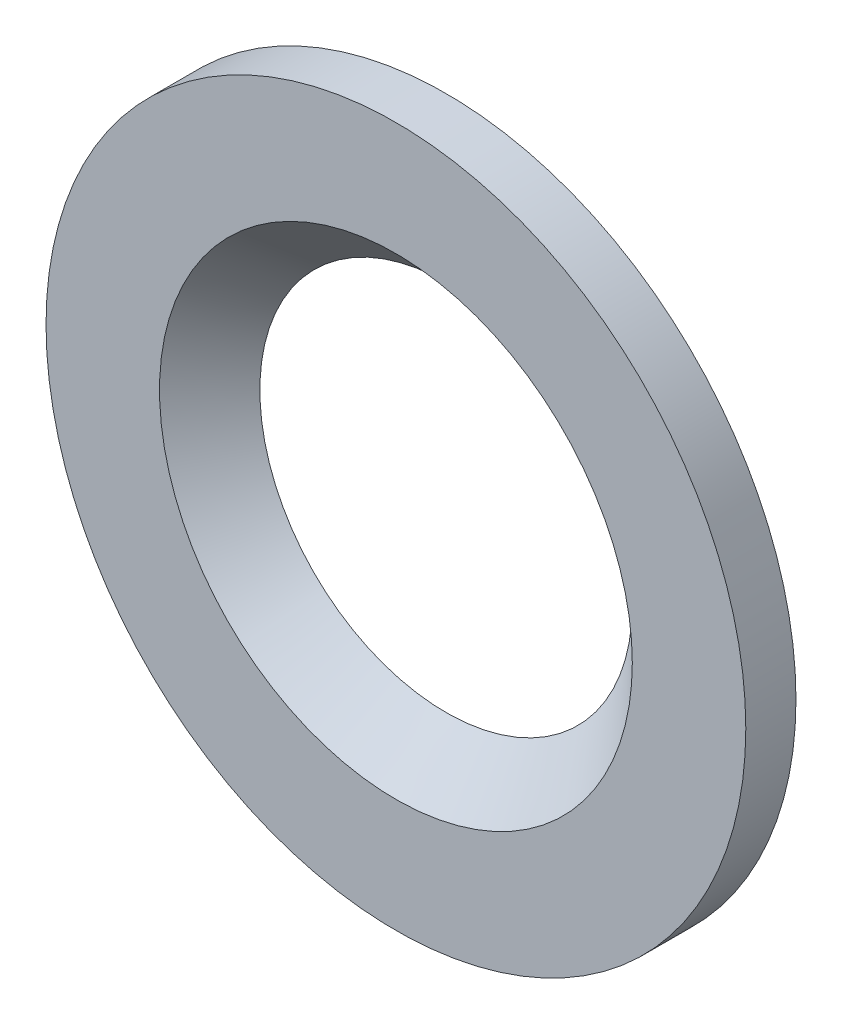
ISO-10303-21;
HEADER;
FILE_DESCRIPTION(('STEP AP214'),'2;1');
FILE_NAME('part.step','',(''),(''),'','','');
FILE_SCHEMA(('AUTOMOTIVE_DESIGN { 1 0 10303 214 1 1 1 1 }'));
ENDSEC;
DATA;
#1=APPLICATION_CONTEXT('core data for automotive mechanical design processes');
#2=APPLICATION_PROTOCOL_DEFINITION('international standard','automotive_design',2000,#1);
#3=PRODUCT_CONTEXT('',#1,'mechanical');
#4=PRODUCT('Part','Part','',(#3));
#5=PRODUCT_RELATED_PRODUCT_CATEGORY('part','',(#4));
#6=PRODUCT_DEFINITION_FORMATION('','',#4);
#7=PRODUCT_DEFINITION_CONTEXT('part definition',#1,'design');
#8=PRODUCT_DEFINITION('design','',#6,#7);
#9=PRODUCT_DEFINITION_SHAPE('','',#8);
#10=(LENGTH_UNIT() NAMED_UNIT(*) SI_UNIT(.MILLI.,.METRE.));
#11=(NAMED_UNIT(*) PLANE_ANGLE_UNIT() SI_UNIT($,.RADIAN.));
#12=(NAMED_UNIT(*) SI_UNIT($,.STERADIAN.) SOLID_ANGLE_UNIT());
#13=UNCERTAINTY_MEASURE_WITH_UNIT(LENGTH_MEASURE(1.E-05),#10,'distance_accuracy_value','');
#14=(GEOMETRIC_REPRESENTATION_CONTEXT(3) GLOBAL_UNCERTAINTY_ASSIGNED_CONTEXT((#13)) GLOBAL_UNIT_ASSIGNED_CONTEXT((#10,
#11,#12)) REPRESENTATION_CONTEXT('',''));
#15=CARTESIAN_POINT('',(0.,0.,0.));
#16=DIRECTION('',(0.,0.,1.));
#17=DIRECTION('',(1.,0.,0.));
#18=AXIS2_PLACEMENT_3D('',#15,#16,#17);
#19=CARTESIAN_POINT('',(0.,0.,-1.016));
#20=DIRECTION('',(0.,0.,1.));
#21=DIRECTION('',(1.,0.,0.));
#22=AXIS2_PLACEMENT_3D('',#19,#20,#21);
#23=PLANE('',#22);
#24=CARTESIAN_POINT('',(0.,0.,-1.016));
#25=DIRECTION('',(0.,0.,1.));
#26=DIRECTION('',(1.,0.,0.));
#27=AXIS2_PLACEMENT_3D('',#24,#25,#26);
#28=CIRCLE('',#27,7.0866);
#29=CARTESIAN_POINT('',(7.0866,0.,-1.016));
#30=VERTEX_POINT('',#29);
#31=EDGE_CURVE('E10',#30,#30,#28,.T.);
#32=ORIENTED_EDGE('',*,*,#31,.F.);
#33=EDGE_LOOP('',(#32));
#34=FACE_BOUND('',#33,.T.);
#35=CARTESIAN_POINT('',(0.,0.,-1.016));
#36=DIRECTION('',(0.,0.,1.));
#37=DIRECTION('',(1.,0.,0.));
#38=AXIS2_PLACEMENT_3D('',#35,#36,#37);
#39=CIRCLE('',#38,3.7719);
#40=CARTESIAN_POINT('',(3.7719,0.,-1.016));
#41=VERTEX_POINT('',#40);
#42=EDGE_CURVE('E43',#41,#41,#39,.T.);
#43=ORIENTED_EDGE('',*,*,#42,.T.);
#44=EDGE_LOOP('',(#43));
#45=FACE_BOUND('',#44,.T.);
#46=ADVANCED_FACE('F28',(#34,#45),#23,.F.);
#47=CARTESIAN_POINT('',(0.,0.,0.));
#48=DIRECTION('',(0.,0.,1.));
#49=DIRECTION('',(1.,0.,0.));
#50=AXIS2_PLACEMENT_3D('',#47,#48,#49);
#51=PLANE('',#50);
#52=CARTESIAN_POINT('',(0.,0.,0.));
#53=DIRECTION('',(0.,0.,1.));
#54=DIRECTION('',(1.,0.,0.));
#55=AXIS2_PLACEMENT_3D('',#52,#53,#54);
#56=CIRCLE('',#55,7.0866);
#57=CARTESIAN_POINT('',(7.0866,0.,0.));
#58=VERTEX_POINT('',#57);
#59=EDGE_CURVE('E32',#58,#58,#56,.T.);
#60=ORIENTED_EDGE('',*,*,#59,.T.);
#61=EDGE_LOOP('',(#60));
#62=FACE_BOUND('',#61,.T.);
#63=CARTESIAN_POINT('',(0.,0.,0.));
#64=DIRECTION('',(0.,0.,1.));
#65=DIRECTION('',(1.,0.,0.));
#66=AXIS2_PLACEMENT_3D('',#63,#64,#65);
#67=CIRCLE('',#66,4.7879);
#68=CARTESIAN_POINT('',(4.7879,0.,0.));
#69=VERTEX_POINT('',#68);
#70=EDGE_CURVE('E39',#69,#69,#67,.T.);
#71=ORIENTED_EDGE('',*,*,#70,.F.);
#72=EDGE_LOOP('',(#71));
#73=FACE_BOUND('',#72,.T.);
#74=ADVANCED_FACE('F55',(#62,#73),#51,.T.);
#75=CARTESIAN_POINT('',(0.,0.,-1.016));
#76=DIRECTION('',(0.,0.,1.));
#77=DIRECTION('',(1.,0.,0.));
#78=AXIS2_PLACEMENT_3D('',#75,#76,#77);
#79=CYLINDRICAL_SURFACE('',#78,7.0866);
#80=ORIENTED_EDGE('',*,*,#31,.T.);
#81=EDGE_LOOP('',(#80));
#82=FACE_BOUND('',#81,.T.);
#83=ORIENTED_EDGE('',*,*,#59,.F.);
#84=EDGE_LOOP('',(#83));
#85=FACE_BOUND('',#84,.T.);
#86=ADVANCED_FACE('F30',(#82,#85),#79,.T.);
#87=CARTESIAN_POINT('',(0.,0.,-1.016));
#88=DIRECTION('',(0.,0.,1.));
#89=DIRECTION('',(1.,0.,0.));
#90=AXIS2_PLACEMENT_3D('',#87,#88,#89);
#91=CONICAL_SURFACE('',#90,3.7719,0.78539816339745);
#92=ORIENTED_EDGE('',*,*,#70,.T.);
#93=EDGE_LOOP('',(#92));
#94=FACE_BOUND('',#93,.T.);
#95=ORIENTED_EDGE('',*,*,#42,.F.);
#96=EDGE_LOOP('',(#95));
#97=FACE_BOUND('',#96,.T.);
#98=ADVANCED_FACE('F48',(#94,#97),#91,.F.);
#99=CLOSED_SHELL('',(#46,#74,#86,#98));
#100=MANIFOLD_SOLID_BREP('B2',#99);
#101=ADVANCED_BREP_SHAPE_REPRESENTATION('',(#18,#100),#14);
#102=SHAPE_DEFINITION_REPRESENTATION(#9,#101);
ENDSEC;
END-ISO-10303-21;
